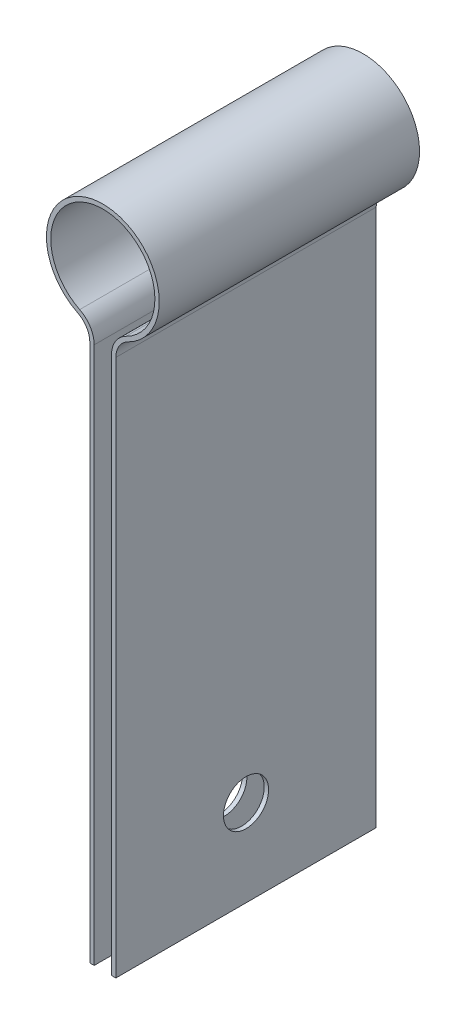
ISO-10303-21;
HEADER;
FILE_DESCRIPTION(('STEP AP214'),'2;1');
FILE_NAME('part.step','',(''),(''),'','','');
FILE_SCHEMA(('AUTOMOTIVE_DESIGN { 1 0 10303 214 1 1 1 1 }'));
ENDSEC;
DATA;
#1=APPLICATION_CONTEXT('core data for automotive mechanical design processes');
#2=APPLICATION_PROTOCOL_DEFINITION('international standard','automotive_design',2000,#1);
#3=PRODUCT_CONTEXT('',#1,'mechanical');
#4=PRODUCT('Part','Part','',(#3));
#5=PRODUCT_RELATED_PRODUCT_CATEGORY('part','',(#4));
#6=PRODUCT_DEFINITION_FORMATION('','',#4);
#7=PRODUCT_DEFINITION_CONTEXT('part definition',#1,'design');
#8=PRODUCT_DEFINITION('design','',#6,#7);
#9=PRODUCT_DEFINITION_SHAPE('','',#8);
#10=(LENGTH_UNIT() NAMED_UNIT(*) SI_UNIT(.MILLI.,.METRE.));
#11=(NAMED_UNIT(*) PLANE_ANGLE_UNIT() SI_UNIT($,.RADIAN.));
#12=(NAMED_UNIT(*) SI_UNIT($,.STERADIAN.) SOLID_ANGLE_UNIT());
#13=UNCERTAINTY_MEASURE_WITH_UNIT(LENGTH_MEASURE(1.E-05),#10,'distance_accuracy_value','');
#14=(GEOMETRIC_REPRESENTATION_CONTEXT(3) GLOBAL_UNCERTAINTY_ASSIGNED_CONTEXT((#13)) GLOBAL_UNIT_ASSIGNED_CONTEXT((#10,
#11,#12)) REPRESENTATION_CONTEXT('',''));
#15=CARTESIAN_POINT('',(0.,0.,0.));
#16=DIRECTION('',(0.,0.,1.));
#17=DIRECTION('',(1.,0.,0.));
#18=AXIS2_PLACEMENT_3D('',#15,#16,#17);
#19=CARTESIAN_POINT('',(3.99999999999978,-8.06225774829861,14.9999999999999));
#20=DIRECTION('',(0.,0.,-1.));
#21=DIRECTION('',(-1.,0.,0.));
#22=AXIS2_PLACEMENT_3D('',#19,#20,#21);
#23=CYLINDRICAL_SURFACE('',#22,3.);
#24=CARTESIAN_POINT('',(4.00000000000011,-8.0622577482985,-15.0000000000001));
#25=DIRECTION('',(0.,0.,1.));
#26=DIRECTION('',(-1.,0.,0.));
#27=AXIS2_PLACEMENT_3D('',#24,#25,#26);
#28=CIRCLE('',#27,3.);
#29=CARTESIAN_POINT('',(2.66666666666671,-5.37483849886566,-15.0000000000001));
#30=VERTEX_POINT('',#29);
#31=CARTESIAN_POINT('',(0.999999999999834,-8.06225774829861,-15.0000000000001));
#32=VERTEX_POINT('',#31);
#33=EDGE_CURVE('E125',#30,#32,#28,.T.);
#34=ORIENTED_EDGE('',*,*,#33,.T.);
#35=DIRECTION('',(0.,0.,-1.));
#36=VECTOR('',#35,1.);
#37=CARTESIAN_POINT('',(0.999999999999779,-8.06225774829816,14.9999999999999));
#38=LINE('',#37,#36);
#39=CARTESIAN_POINT('',(0.999999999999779,-8.06225774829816,14.9999999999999));
#40=VERTEX_POINT('',#39);
#41=EDGE_CURVE('E11',#40,#32,#38,.T.);
#42=ORIENTED_EDGE('',*,*,#41,.F.);
#43=CARTESIAN_POINT('',(3.99999999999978,-8.06225774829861,14.9999999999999));
#44=DIRECTION('',(0.,0.,1.));
#45=DIRECTION('',(-1.,0.,0.));
#46=AXIS2_PLACEMENT_3D('',#43,#44,#45);
#47=CIRCLE('',#46,3.);
#48=CARTESIAN_POINT('',(2.66666666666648,-5.37483849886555,15.));
#49=VERTEX_POINT('',#48);
#50=EDGE_CURVE('E165',#49,#40,#47,.T.);
#51=ORIENTED_EDGE('',*,*,#50,.F.);
#52=DIRECTION('',(0.,0.,-1.));
#53=VECTOR('',#52,1.);
#54=CARTESIAN_POINT('',(2.66666666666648,-5.37483849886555,15.));
#55=LINE('',#54,#53);
#56=EDGE_CURVE('E138',#49,#30,#55,.T.);
#57=ORIENTED_EDGE('',*,*,#56,.T.);
#58=EDGE_LOOP('',(#34,#42,#51,#57));
#59=FACE_BOUND('',#58,.T.);
#60=ADVANCED_FACE('F32',(#59),#23,.T.);
#61=CARTESIAN_POINT('',(0.999999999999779,-8.06225774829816,14.9999999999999));
#62=DIRECTION('',(1.00000000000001,0.,0.));
#63=DIRECTION('',(0.,1.00000000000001,0.));
#64=AXIS2_PLACEMENT_3D('',#61,#62,#63);
#65=PLANE('',#64);
#66=CARTESIAN_POINT('',(0.999999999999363,-60.0000000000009,-1.11022302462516E-13));
#67=DIRECTION('',(1.00000000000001,0.,0.));
#68=DIRECTION('',(0.,1.00000000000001,0.));
#69=AXIS2_PLACEMENT_3D('',#66,#67,#68);
#70=CIRCLE('',#69,2.6);
#71=CARTESIAN_POINT('',(0.999999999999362,-57.4000000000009,-1.11022302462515E-13));
#72=VERTEX_POINT('',#71);
#73=EDGE_CURVE('E139',#72,#72,#70,.T.);
#74=ORIENTED_EDGE('',*,*,#73,.T.);
#75=EDGE_LOOP('',(#74));
#76=FACE_BOUND('',#75,.T.);
#77=DIRECTION('',(0.,-1.00000000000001,0.));
#78=VECTOR('',#77,1.);
#79=CARTESIAN_POINT('',(0.999999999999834,-8.06225774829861,-15.0000000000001));
#80=LINE('',#79,#78);
#81=CARTESIAN_POINT('',(0.999999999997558,-69.9999999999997,-15.0000000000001));
#82=VERTEX_POINT('',#81);
#83=EDGE_CURVE('E121',#32,#82,#80,.T.);
#84=ORIENTED_EDGE('',*,*,#83,.T.);
#85=DIRECTION('',(0.,0.,-1.));
#86=VECTOR('',#85,1.);
#87=CARTESIAN_POINT('',(0.999999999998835,-70.0000000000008,14.9999999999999));
#88=LINE('',#87,#86);
#89=CARTESIAN_POINT('',(0.999999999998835,-70.0000000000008,14.9999999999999));
#90=VERTEX_POINT('',#89);
#91=EDGE_CURVE('E40',#90,#82,#88,.T.);
#92=ORIENTED_EDGE('',*,*,#91,.F.);
#93=DIRECTION('',(0.,-1.00000000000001,0.));
#94=VECTOR('',#93,1.);
#95=CARTESIAN_POINT('',(0.999999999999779,-8.06225774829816,14.9999999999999));
#96=LINE('',#95,#94);
#97=EDGE_CURVE('E134',#40,#90,#96,.T.);
#98=ORIENTED_EDGE('',*,*,#97,.F.);
#99=ORIENTED_EDGE('',*,*,#41,.T.);
#100=EDGE_LOOP('',(#84,#92,#98,#99));
#101=FACE_BOUND('',#100,.T.);
#102=ADVANCED_FACE('F133',(#76,#101),#65,.F.);
#103=CARTESIAN_POINT('',(0.999999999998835,-70.0000000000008,14.9999999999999));
#104=DIRECTION('',(0.,1.,0.));
#105=DIRECTION('',(0.,0.,1.));
#106=AXIS2_PLACEMENT_3D('',#103,#104,#105);
#107=PLANE('',#106);
#108=DIRECTION('',(1.,0.,0.));
#109=VECTOR('',#108,1.);
#110=CARTESIAN_POINT('',(0.999999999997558,-69.9999999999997,-15.0000000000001));
#111=LINE('',#110,#109);
#112=CARTESIAN_POINT('',(1.49999999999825,-70.0000000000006,-15.0000000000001));
#113=VERTEX_POINT('',#112);
#114=EDGE_CURVE('E127',#82,#113,#111,.T.);
#115=ORIENTED_EDGE('',*,*,#114,.T.);
#116=DIRECTION('',(0.,0.,-1.));
#117=VECTOR('',#116,1.);
#118=CARTESIAN_POINT('',(1.49999999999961,-70.0000000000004,14.9999999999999));
#119=LINE('',#118,#117);
#120=CARTESIAN_POINT('',(1.49999999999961,-70.0000000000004,14.9999999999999));
#121=VERTEX_POINT('',#120);
#122=EDGE_CURVE('E211',#121,#113,#119,.T.);
#123=ORIENTED_EDGE('',*,*,#122,.F.);
#124=DIRECTION('',(1.,0.,0.));
#125=VECTOR('',#124,1.);
#126=CARTESIAN_POINT('',(0.999999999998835,-70.0000000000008,14.9999999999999));
#127=LINE('',#126,#125);
#128=EDGE_CURVE('E168',#90,#121,#127,.T.);
#129=ORIENTED_EDGE('',*,*,#128,.F.);
#130=ORIENTED_EDGE('',*,*,#91,.T.);
#131=EDGE_LOOP('',(#115,#123,#129,#130));
#132=FACE_BOUND('',#131,.T.);
#133=ADVANCED_FACE('F216',(#132),#107,.F.);
#134=CARTESIAN_POINT('',(1.49999999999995,-8.06225774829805,14.9999999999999));
#135=DIRECTION('',(-1.,0.,0.));
#136=DIRECTION('',(0.,-1.00000000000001,0.));
#137=AXIS2_PLACEMENT_3D('',#134,#135,#136);
#138=PLANE('',#137);
#139=CARTESIAN_POINT('',(1.49999999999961,-60.0000000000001,-1.11022302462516E-13));
#140=DIRECTION('',(-1.,0.,0.));
#141=DIRECTION('',(0.,-1.00000000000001,0.));
#142=AXIS2_PLACEMENT_3D('',#139,#140,#141);
#143=CIRCLE('',#142,2.6);
#144=CARTESIAN_POINT('',(1.49999999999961,-62.6000000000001,-1.11022302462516E-13));
#145=VERTEX_POINT('',#144);
#146=EDGE_CURVE('E142',#145,#145,#143,.T.);
#147=ORIENTED_EDGE('',*,*,#146,.T.);
#148=EDGE_LOOP('',(#147));
#149=FACE_BOUND('',#148,.T.);
#150=DIRECTION('',(0.,1.00000000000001,0.));
#151=VECTOR('',#150,1.);
#152=CARTESIAN_POINT('',(1.49999999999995,-8.06225774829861,-15.0000000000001));
#153=LINE('',#152,#151);
#154=CARTESIAN_POINT('',(1.49999999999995,-8.06225774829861,-15.0000000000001));
#155=VERTEX_POINT('',#154);
#156=EDGE_CURVE('E147',#113,#155,#153,.T.);
#157=ORIENTED_EDGE('',*,*,#156,.T.);
#158=DIRECTION('',(0.,0.,-1.));
#159=VECTOR('',#158,1.);
#160=CARTESIAN_POINT('',(1.49999999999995,-8.06225774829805,14.9999999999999));
#161=LINE('',#160,#159);
#162=CARTESIAN_POINT('',(1.49999999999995,-8.06225774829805,14.9999999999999));
#163=VERTEX_POINT('',#162);
#164=EDGE_CURVE('E208',#163,#155,#161,.T.);
#165=ORIENTED_EDGE('',*,*,#164,.F.);
#166=DIRECTION('',(0.,1.00000000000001,0.));
#167=VECTOR('',#166,1.);
#168=CARTESIAN_POINT('',(1.49999999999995,-8.06225774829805,14.9999999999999));
#169=LINE('',#168,#167);
#170=EDGE_CURVE('E170',#121,#163,#169,.T.);
#171=ORIENTED_EDGE('',*,*,#170,.F.);
#172=ORIENTED_EDGE('',*,*,#122,.T.);
#173=EDGE_LOOP('',(#157,#165,#171,#172));
#174=FACE_BOUND('',#173,.T.);
#175=ADVANCED_FACE('F224',(#149,#174),#138,.F.);
#176=CARTESIAN_POINT('',(3.99999999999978,-8.06225774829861,14.9999999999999));
#177=DIRECTION('',(0.,0.,-1.));
#178=DIRECTION('',(-1.,0.,0.));
#179=AXIS2_PLACEMENT_3D('',#176,#177,#178);
#180=CYLINDRICAL_SURFACE('',#179,2.5);
#181=CARTESIAN_POINT('',(4.00000000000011,-8.0622577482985,-15.0000000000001));
#182=DIRECTION('',(0.,0.,-1.));
#183=DIRECTION('',(-1.,0.,0.));
#184=AXIS2_PLACEMENT_3D('',#181,#182,#183);
#185=CIRCLE('',#184,2.5);
#186=CARTESIAN_POINT('',(2.88888888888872,-5.82274170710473,-15.0000000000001));
#187=VERTEX_POINT('',#186);
#188=EDGE_CURVE('E149',#155,#187,#185,.T.);
#189=ORIENTED_EDGE('',*,*,#188,.T.);
#190=DIRECTION('',(0.,0.,-1.));
#191=VECTOR('',#190,1.);
#192=CARTESIAN_POINT('',(2.88888888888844,-5.82274170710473,15.));
#193=LINE('',#192,#191);
#194=CARTESIAN_POINT('',(2.88888888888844,-5.82274170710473,15.));
#195=VERTEX_POINT('',#194);
#196=EDGE_CURVE('E205',#195,#187,#193,.T.);
#197=ORIENTED_EDGE('',*,*,#196,.F.);
#198=CARTESIAN_POINT('',(3.99999999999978,-8.06225774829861,14.9999999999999));
#199=DIRECTION('',(0.,0.,-1.));
#200=DIRECTION('',(-1.,0.,0.));
#201=AXIS2_PLACEMENT_3D('',#198,#199,#200);
#202=CIRCLE('',#201,2.5);
#203=EDGE_CURVE('E172',#163,#195,#202,.T.);
#204=ORIENTED_EDGE('',*,*,#203,.F.);
#205=ORIENTED_EDGE('',*,*,#164,.T.);
#206=EDGE_LOOP('',(#189,#197,#204,#205));
#207=FACE_BOUND('',#206,.T.);
#208=ADVANCED_FACE('F227',(#207),#180,.F.);
#209=CARTESIAN_POINT('',(0.,0.,15.));
#210=DIRECTION('',(0.,0.,-1.));
#211=DIRECTION('',(-1.,0.,0.));
#212=AXIS2_PLACEMENT_3D('',#209,#210,#211);
#213=CYLINDRICAL_SURFACE('',#212,6.5);
#214=CARTESIAN_POINT('',(0.,0.,-15.));
#215=DIRECTION('',(0.,0.,1.));
#216=DIRECTION('',(1.,0.,0.));
#217=AXIS2_PLACEMENT_3D('',#214,#215,#216);
#218=CIRCLE('',#217,6.5);
#219=CARTESIAN_POINT('',(-2.88888888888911,-5.82274170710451,-15.));
#220=VERTEX_POINT('',#219);
#221=EDGE_CURVE('E151',#187,#220,#218,.T.);
#222=ORIENTED_EDGE('',*,*,#221,.T.);
#223=DIRECTION('',(0.,0.,-1.));
#224=VECTOR('',#223,1.);
#225=CARTESIAN_POINT('',(-2.88888888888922,-5.82274170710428,15.));
#226=LINE('',#225,#224);
#227=CARTESIAN_POINT('',(-2.88888888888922,-5.82274170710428,15.));
#228=VERTEX_POINT('',#227);
#229=EDGE_CURVE('E202',#228,#220,#226,.T.);
#230=ORIENTED_EDGE('',*,*,#229,.F.);
#231=CARTESIAN_POINT('',(0.,0.,15.));
#232=DIRECTION('',(0.,0.,1.));
#233=DIRECTION('',(1.,0.,0.));
#234=AXIS2_PLACEMENT_3D('',#231,#232,#233);
#235=CIRCLE('',#234,6.5);
#236=EDGE_CURVE('E174',#195,#228,#235,.T.);
#237=ORIENTED_EDGE('',*,*,#236,.F.);
#238=ORIENTED_EDGE('',*,*,#196,.T.);
#239=EDGE_LOOP('',(#222,#230,#237,#238));
#240=FACE_BOUND('',#239,.T.);
#241=ADVANCED_FACE('F232',(#240),#213,.T.);
#242=CARTESIAN_POINT('',(-4.00000000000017,-8.06225774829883,15.));
#243=DIRECTION('',(0.,0.,-1.));
#244=DIRECTION('',(-1.,0.,0.));
#245=AXIS2_PLACEMENT_3D('',#242,#243,#244);
#246=CYLINDRICAL_SURFACE('',#245,2.5);
#247=CARTESIAN_POINT('',(-4.00000000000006,-8.06225774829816,-15.0000000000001));
#248=DIRECTION('',(0.,0.,-1.));
#249=DIRECTION('',(1.,0.,0.));
#250=AXIS2_PLACEMENT_3D('',#247,#248,#249);
#251=CIRCLE('',#250,2.5);
#252=CARTESIAN_POINT('',(-1.50000000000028,-8.06225774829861,-15.0000000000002));
#253=VERTEX_POINT('',#252);
#254=EDGE_CURVE('E153',#220,#253,#251,.T.);
#255=ORIENTED_EDGE('',*,*,#254,.T.);
#256=DIRECTION('',(0.,0.,-1.));
#257=VECTOR('',#256,1.);
#258=CARTESIAN_POINT('',(-1.50000000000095,-8.06225774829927,14.9999999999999));
#259=LINE('',#258,#257);
#260=CARTESIAN_POINT('',(-1.50000000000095,-8.06225774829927,14.9999999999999));
#261=VERTEX_POINT('',#260);
#262=EDGE_CURVE('E199',#261,#253,#259,.T.);
#263=ORIENTED_EDGE('',*,*,#262,.F.);
#264=CARTESIAN_POINT('',(-4.00000000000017,-8.06225774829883,15.));
#265=DIRECTION('',(0.,0.,-1.));
#266=DIRECTION('',(1.,0.,0.));
#267=AXIS2_PLACEMENT_3D('',#264,#265,#266);
#268=CIRCLE('',#267,2.5);
#269=EDGE_CURVE('E176',#228,#261,#268,.T.);
#270=ORIENTED_EDGE('',*,*,#269,.F.);
#271=ORIENTED_EDGE('',*,*,#229,.T.);
#272=EDGE_LOOP('',(#255,#263,#270,#271));
#273=FACE_BOUND('',#272,.T.);
#274=ADVANCED_FACE('F238',(#273),#246,.F.);
#275=CARTESIAN_POINT('',(-1.50000000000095,-8.06225774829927,14.9999999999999));
#276=DIRECTION('',(1.00000000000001,0.,0.));
#277=DIRECTION('',(0.,1.00000000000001,0.));
#278=AXIS2_PLACEMENT_3D('',#275,#276,#277);
#279=PLANE('',#278);
#280=CARTESIAN_POINT('',(-1.50000000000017,-59.9999999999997,-1.11022302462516E-13));
#281=DIRECTION('',(-1.00000000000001,0.,0.));
#282=DIRECTION('',(0.,-1.00000000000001,0.));
#283=AXIS2_PLACEMENT_3D('',#280,#281,#282);
#284=CIRCLE('',#283,2.6);
#285=CARTESIAN_POINT('',(-1.50000000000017,-62.5999999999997,-1.11022302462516E-13));
#286=VERTEX_POINT('',#285);
#287=EDGE_CURVE('E297',#286,#286,#284,.T.);
#288=ORIENTED_EDGE('',*,*,#287,.F.);
#289=EDGE_LOOP('',(#288));
#290=FACE_BOUND('',#289,.T.);
#291=DIRECTION('',(0.,-1.00000000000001,0.));
#292=VECTOR('',#291,1.);
#293=CARTESIAN_POINT('',(-1.50000000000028,-8.06225774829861,-15.0000000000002));
#294=LINE('',#293,#292);
#295=CARTESIAN_POINT('',(-1.50000000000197,-70.,-15.0000000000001));
#296=VERTEX_POINT('',#295);
#297=EDGE_CURVE('E155',#253,#296,#294,.T.);
#298=ORIENTED_EDGE('',*,*,#297,.T.);
#299=DIRECTION('',(0.,0.,-1.));
#300=VECTOR('',#299,1.);
#301=CARTESIAN_POINT('',(-1.5000000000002,-70.0000000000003,14.9999999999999));
#302=LINE('',#301,#300);
#303=CARTESIAN_POINT('',(-1.5000000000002,-70.0000000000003,14.9999999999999));
#304=VERTEX_POINT('',#303);
#305=EDGE_CURVE('E196',#304,#296,#302,.T.);
#306=ORIENTED_EDGE('',*,*,#305,.F.);
#307=DIRECTION('',(0.,-1.00000000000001,0.));
#308=VECTOR('',#307,1.);
#309=CARTESIAN_POINT('',(-1.50000000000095,-8.06225774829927,14.9999999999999));
#310=LINE('',#309,#308);
#311=EDGE_CURVE('E178',#261,#304,#310,.T.);
#312=ORIENTED_EDGE('',*,*,#311,.F.);
#313=ORIENTED_EDGE('',*,*,#262,.T.);
#314=EDGE_LOOP('',(#298,#306,#312,#313));
#315=FACE_BOUND('',#314,.T.);
#316=ADVANCED_FACE('F242',(#290,#315),#279,.F.);
#317=CARTESIAN_POINT('',(-1.5000000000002,-70.0000000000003,14.9999999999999));
#318=DIRECTION('',(0.,1.,0.));
#319=DIRECTION('',(0.,0.,1.));
#320=AXIS2_PLACEMENT_3D('',#317,#318,#319);
#321=PLANE('',#320);
#322=DIRECTION('',(1.,0.,0.));
#323=VECTOR('',#322,1.);
#324=CARTESIAN_POINT('',(-1.50000000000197,-70.,-15.0000000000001));
#325=LINE('',#324,#323);
#326=CARTESIAN_POINT('',(-1.00000000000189,-70.0000000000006,-15.));
#327=VERTEX_POINT('',#326);
#328=EDGE_CURVE('E157',#296,#327,#325,.T.);
#329=ORIENTED_EDGE('',*,*,#328,.T.);
#330=DIRECTION('',(0.,0.,-1.));
#331=VECTOR('',#330,1.);
#332=CARTESIAN_POINT('',(-1.00000000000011,-70.0000000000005,15.));
#333=LINE('',#332,#331);
#334=CARTESIAN_POINT('',(-1.00000000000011,-70.0000000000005,15.));
#335=VERTEX_POINT('',#334);
#336=EDGE_CURVE('E193',#335,#327,#333,.T.);
#337=ORIENTED_EDGE('',*,*,#336,.F.);
#338=DIRECTION('',(1.,0.,0.));
#339=VECTOR('',#338,1.);
#340=CARTESIAN_POINT('',(-1.5000000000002,-70.0000000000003,14.9999999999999));
#341=LINE('',#340,#339);
#342=EDGE_CURVE('E180',#304,#335,#341,.T.);
#343=ORIENTED_EDGE('',*,*,#342,.F.);
#344=ORIENTED_EDGE('',*,*,#305,.T.);
#345=EDGE_LOOP('',(#329,#337,#343,#344));
#346=FACE_BOUND('',#345,.T.);
#347=ADVANCED_FACE('F247',(#346),#321,.F.);
#348=CARTESIAN_POINT('',(-1.00000000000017,-8.06225774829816,14.9999999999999));
#349=DIRECTION('',(-1.00000000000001,0.,0.));
#350=DIRECTION('',(0.,-1.00000000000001,0.));
#351=AXIS2_PLACEMENT_3D('',#348,#349,#350);
#352=PLANE('',#351);
#353=CARTESIAN_POINT('',(-1.00000000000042,-60.0000000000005,0.));
#354=DIRECTION('',(-1.00000000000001,0.,0.));
#355=DIRECTION('',(0.,-1.00000000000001,0.));
#356=AXIS2_PLACEMENT_3D('',#353,#354,#355);
#357=CIRCLE('',#356,2.6);
#358=CARTESIAN_POINT('',(-1.00000000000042,-62.6000000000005,0.));
#359=VERTEX_POINT('',#358);
#360=EDGE_CURVE('E35',#359,#359,#357,.T.);
#361=ORIENTED_EDGE('',*,*,#360,.T.);
#362=EDGE_LOOP('',(#361));
#363=FACE_BOUND('',#362,.T.);
#364=DIRECTION('',(0.,1.00000000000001,0.));
#365=VECTOR('',#364,1.);
#366=CARTESIAN_POINT('',(-0.99999999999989,-8.06225774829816,-15.0000000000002));
#367=LINE('',#366,#365);
#368=CARTESIAN_POINT('',(-0.99999999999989,-8.06225774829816,-15.0000000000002));
#369=VERTEX_POINT('',#368);
#370=EDGE_CURVE('E159',#327,#369,#367,.T.);
#371=ORIENTED_EDGE('',*,*,#370,.T.);
#372=DIRECTION('',(0.,0.,-1.));
#373=VECTOR('',#372,1.);
#374=CARTESIAN_POINT('',(-1.00000000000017,-8.06225774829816,14.9999999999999));
#375=LINE('',#374,#373);
#376=CARTESIAN_POINT('',(-1.00000000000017,-8.06225774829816,14.9999999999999));
#377=VERTEX_POINT('',#376);
#378=EDGE_CURVE('E190',#377,#369,#375,.T.);
#379=ORIENTED_EDGE('',*,*,#378,.F.);
#380=DIRECTION('',(0.,1.00000000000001,0.));
#381=VECTOR('',#380,1.);
#382=CARTESIAN_POINT('',(-1.00000000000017,-8.06225774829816,14.9999999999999));
#383=LINE('',#382,#381);
#384=EDGE_CURVE('E182',#335,#377,#383,.T.);
#385=ORIENTED_EDGE('',*,*,#384,.F.);
#386=ORIENTED_EDGE('',*,*,#336,.T.);
#387=EDGE_LOOP('',(#371,#379,#385,#386));
#388=FACE_BOUND('',#387,.T.);
#389=ADVANCED_FACE('F251',(#363,#388),#352,.F.);
#390=CARTESIAN_POINT('',(-4.00000000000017,-8.06225774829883,15.));
#391=DIRECTION('',(0.,0.,-1.));
#392=DIRECTION('',(-1.,0.,0.));
#393=AXIS2_PLACEMENT_3D('',#390,#391,#392);
#394=CYLINDRICAL_SURFACE('',#393,3.);
#395=CARTESIAN_POINT('',(-4.00000000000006,-8.06225774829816,-15.0000000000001));
#396=DIRECTION('',(0.,0.,1.));
#397=DIRECTION('',(1.,0.,0.));
#398=AXIS2_PLACEMENT_3D('',#395,#396,#397);
#399=CIRCLE('',#398,3.);
#400=CARTESIAN_POINT('',(-2.66666666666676,-5.37483849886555,-15.));
#401=VERTEX_POINT('',#400);
#402=EDGE_CURVE('E161',#369,#401,#399,.T.);
#403=ORIENTED_EDGE('',*,*,#402,.T.);
#404=DIRECTION('',(0.,0.,-1.));
#405=VECTOR('',#404,1.);
#406=CARTESIAN_POINT('',(-2.66666666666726,-5.37483849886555,15.));
#407=LINE('',#406,#405);
#408=CARTESIAN_POINT('',(-2.66666666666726,-5.37483849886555,15.));
#409=VERTEX_POINT('',#408);
#410=EDGE_CURVE('E187',#409,#401,#407,.T.);
#411=ORIENTED_EDGE('',*,*,#410,.F.);
#412=CARTESIAN_POINT('',(-4.00000000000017,-8.06225774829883,15.));
#413=DIRECTION('',(0.,0.,1.));
#414=DIRECTION('',(1.,0.,0.));
#415=AXIS2_PLACEMENT_3D('',#412,#413,#414);
#416=CIRCLE('',#415,3.);
#417=EDGE_CURVE('E52',#377,#409,#416,.T.);
#418=ORIENTED_EDGE('',*,*,#417,.F.);
#419=ORIENTED_EDGE('',*,*,#378,.T.);
#420=EDGE_LOOP('',(#403,#411,#418,#419));
#421=FACE_BOUND('',#420,.T.);
#422=ADVANCED_FACE('F255',(#421),#394,.T.);
#423=CARTESIAN_POINT('',(0.,0.,15.));
#424=DIRECTION('',(0.,0.,-1.));
#425=DIRECTION('',(-1.,0.,0.));
#426=AXIS2_PLACEMENT_3D('',#423,#424,#425);
#427=CYLINDRICAL_SURFACE('',#426,6.);
#428=CARTESIAN_POINT('',(0.,0.,-15.));
#429=DIRECTION('',(0.,0.,-1.));
#430=DIRECTION('',(1.,0.,0.));
#431=AXIS2_PLACEMENT_3D('',#428,#429,#430);
#432=CIRCLE('',#431,6.);
#433=EDGE_CURVE('E163',#401,#30,#432,.T.);
#434=ORIENTED_EDGE('',*,*,#433,.T.);
#435=ORIENTED_EDGE('',*,*,#56,.F.);
#436=CARTESIAN_POINT('',(0.,0.,15.));
#437=DIRECTION('',(0.,0.,-1.));
#438=DIRECTION('',(1.,0.,0.));
#439=AXIS2_PLACEMENT_3D('',#436,#437,#438);
#440=CIRCLE('',#439,6.);
#441=EDGE_CURVE('E47',#409,#49,#440,.T.);
#442=ORIENTED_EDGE('',*,*,#441,.F.);
#443=ORIENTED_EDGE('',*,*,#410,.T.);
#444=EDGE_LOOP('',(#434,#435,#442,#443));
#445=FACE_BOUND('',#444,.T.);
#446=ADVANCED_FACE('F257',(#445),#427,.F.);
#447=CARTESIAN_POINT('',(3.99999999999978,-8.06225774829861,14.9999999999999));
#448=DIRECTION('',(0.,0.,-1.));
#449=DIRECTION('',(-1.,0.,0.));
#450=AXIS2_PLACEMENT_3D('',#447,#448,#449);
#451=PLANE('',#450);
#452=ORIENTED_EDGE('',*,*,#50,.T.);
#453=ORIENTED_EDGE('',*,*,#97,.T.);
#454=ORIENTED_EDGE('',*,*,#128,.T.);
#455=ORIENTED_EDGE('',*,*,#170,.T.);
#456=ORIENTED_EDGE('',*,*,#203,.T.);
#457=ORIENTED_EDGE('',*,*,#236,.T.);
#458=ORIENTED_EDGE('',*,*,#269,.T.);
#459=ORIENTED_EDGE('',*,*,#311,.T.);
#460=ORIENTED_EDGE('',*,*,#342,.T.);
#461=ORIENTED_EDGE('',*,*,#384,.T.);
#462=ORIENTED_EDGE('',*,*,#417,.T.);
#463=ORIENTED_EDGE('',*,*,#441,.T.);
#464=EDGE_LOOP('',(#452,#453,#454,#455,#456,#457,#458,#459,#460,#461,#462,#463));
#465=FACE_BOUND('',#464,.T.);
#466=ADVANCED_FACE('F219',(#465),#451,.F.);
#467=CARTESIAN_POINT('',(4.00000000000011,-8.0622577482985,-15.0000000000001));
#468=DIRECTION('',(0.,0.,-1.));
#469=DIRECTION('',(-1.,0.,0.));
#470=AXIS2_PLACEMENT_3D('',#467,#468,#469);
#471=PLANE('',#470);
#472=ORIENTED_EDGE('',*,*,#33,.F.);
#473=ORIENTED_EDGE('',*,*,#433,.F.);
#474=ORIENTED_EDGE('',*,*,#402,.F.);
#475=ORIENTED_EDGE('',*,*,#370,.F.);
#476=ORIENTED_EDGE('',*,*,#328,.F.);
#477=ORIENTED_EDGE('',*,*,#297,.F.);
#478=ORIENTED_EDGE('',*,*,#254,.F.);
#479=ORIENTED_EDGE('',*,*,#221,.F.);
#480=ORIENTED_EDGE('',*,*,#188,.F.);
#481=ORIENTED_EDGE('',*,*,#156,.F.);
#482=ORIENTED_EDGE('',*,*,#114,.F.);
#483=ORIENTED_EDGE('',*,*,#83,.F.);
#484=EDGE_LOOP('',(#472,#473,#474,#475,#476,#477,#478,#479,#480,#481,#482,#483));
#485=FACE_BOUND('',#484,.T.);
#486=ADVANCED_FACE('F122',(#485),#471,.T.);
#487=CARTESIAN_POINT('',(6.49999999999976,-59.9999999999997,0.));
#488=DIRECTION('',(-1.00000000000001,0.,0.));
#489=DIRECTION('',(0.,-1.00000000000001,0.));
#490=AXIS2_PLACEMENT_3D('',#487,#488,#489);
#491=CYLINDRICAL_SURFACE('',#490,2.6);
#492=ORIENTED_EDGE('',*,*,#287,.T.);
#493=EDGE_LOOP('',(#492));
#494=FACE_BOUND('',#493,.T.);
#495=ORIENTED_EDGE('',*,*,#360,.F.);
#496=EDGE_LOOP('',(#495));
#497=FACE_BOUND('',#496,.T.);
#498=ADVANCED_FACE('F303',(#494,#497),#491,.F.);
#499=ORIENTED_EDGE('',*,*,#146,.F.);
#500=EDGE_LOOP('',(#499));
#501=FACE_BOUND('',#500,.T.);
#502=ORIENTED_EDGE('',*,*,#73,.F.);
#503=EDGE_LOOP('',(#502));
#504=FACE_BOUND('',#503,.T.);
#505=ADVANCED_FACE('F305',(#501,#504),#491,.F.);
#506=CLOSED_SHELL('',(#60,#102,#133,#175,#208,#241,#274,#316,#347,#389,#422,#446,#466,#486,#498,#505));
#507=MANIFOLD_SOLID_BREP('B2',#506);
#508=ADVANCED_BREP_SHAPE_REPRESENTATION('',(#18,#507),#14);
#509=SHAPE_DEFINITION_REPRESENTATION(#9,#508);
ENDSEC;
END-ISO-10303-21;
